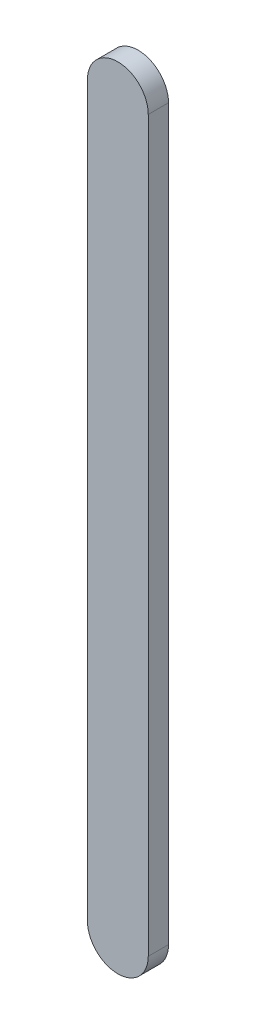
ISO-10303-21;
HEADER;
FILE_DESCRIPTION(('STEP AP214'),'2;1');
FILE_NAME('part.step','',(''),(''),'','','');
FILE_SCHEMA(('AUTOMOTIVE_DESIGN { 1 0 10303 214 1 1 1 1 }'));
ENDSEC;
DATA;
#1=APPLICATION_CONTEXT('core data for automotive mechanical design processes');
#2=APPLICATION_PROTOCOL_DEFINITION('international standard','automotive_design',2000,#1);
#3=PRODUCT_CONTEXT('',#1,'mechanical');
#4=PRODUCT('Part','Part','',(#3));
#5=PRODUCT_RELATED_PRODUCT_CATEGORY('part','',(#4));
#6=PRODUCT_DEFINITION_FORMATION('','',#4);
#7=PRODUCT_DEFINITION_CONTEXT('part definition',#1,'design');
#8=PRODUCT_DEFINITION('design','',#6,#7);
#9=PRODUCT_DEFINITION_SHAPE('','',#8);
#10=(LENGTH_UNIT() NAMED_UNIT(*) SI_UNIT(.MILLI.,.METRE.));
#11=(NAMED_UNIT(*) PLANE_ANGLE_UNIT() SI_UNIT($,.RADIAN.));
#12=(NAMED_UNIT(*) SI_UNIT($,.STERADIAN.) SOLID_ANGLE_UNIT());
#13=UNCERTAINTY_MEASURE_WITH_UNIT(LENGTH_MEASURE(1.E-05),#10,'distance_accuracy_value','');
#14=(GEOMETRIC_REPRESENTATION_CONTEXT(3) GLOBAL_UNCERTAINTY_ASSIGNED_CONTEXT((#13)) GLOBAL_UNIT_ASSIGNED_CONTEXT((#10,
#11,#12)) REPRESENTATION_CONTEXT('',''));
#15=CARTESIAN_POINT('',(0.,0.,0.));
#16=DIRECTION('',(0.,0.,1.));
#17=DIRECTION('',(1.,0.,0.));
#18=AXIS2_PLACEMENT_3D('',#15,#16,#17);
#19=CARTESIAN_POINT('',(0.,0.,3.175));
#20=DIRECTION('',(0.,0.,-1.));
#21=DIRECTION('',(-1.,0.,0.));
#22=AXIS2_PLACEMENT_3D('',#19,#20,#21);
#23=CYLINDRICAL_SURFACE('',#22,4.7625);
#24=CARTESIAN_POINT('',(0.,0.,0.));
#25=DIRECTION('',(0.,0.,1.));
#26=DIRECTION('',(1.,0.,0.));
#27=AXIS2_PLACEMENT_3D('',#24,#25,#26);
#28=CIRCLE('',#27,4.7625);
#29=CARTESIAN_POINT('',(4.7625,0.,0.));
#30=VERTEX_POINT('',#29);
#31=CARTESIAN_POINT('',(-4.7625,0.,0.));
#32=VERTEX_POINT('',#31);
#33=EDGE_CURVE('E100',#30,#32,#28,.T.);
#34=ORIENTED_EDGE('',*,*,#33,.T.);
#35=DIRECTION('',(0.,0.,-1.));
#36=VECTOR('',#35,1.);
#37=CARTESIAN_POINT('',(-4.7625,0.,3.175));
#38=LINE('',#37,#36);
#39=CARTESIAN_POINT('',(-4.7625,0.,3.175));
#40=VERTEX_POINT('',#39);
#41=EDGE_CURVE('E11',#40,#32,#38,.T.);
#42=ORIENTED_EDGE('',*,*,#41,.F.);
#43=CARTESIAN_POINT('',(0.,0.,3.175));
#44=DIRECTION('',(0.,0.,1.));
#45=DIRECTION('',(1.,0.,0.));
#46=AXIS2_PLACEMENT_3D('',#43,#44,#45);
#47=CIRCLE('',#46,4.7625);
#48=CARTESIAN_POINT('',(4.7625,0.,3.175));
#49=VERTEX_POINT('',#48);
#50=EDGE_CURVE('E88',#49,#40,#47,.T.);
#51=ORIENTED_EDGE('',*,*,#50,.F.);
#52=DIRECTION('',(0.,0.,-1.));
#53=VECTOR('',#52,1.);
#54=CARTESIAN_POINT('',(4.7625,0.,3.175));
#55=LINE('',#54,#53);
#56=EDGE_CURVE('E96',#49,#30,#55,.T.);
#57=ORIENTED_EDGE('',*,*,#56,.T.);
#58=EDGE_LOOP('',(#34,#42,#51,#57));
#59=FACE_BOUND('',#58,.T.);
#60=ADVANCED_FACE('F37',(#59),#23,.T.);
#61=CARTESIAN_POINT('',(-4.7625,0.,3.175));
#62=DIRECTION('',(1.,0.,0.));
#63=DIRECTION('',(0.,0.,-1.));
#64=AXIS2_PLACEMENT_3D('',#61,#62,#63);
#65=PLANE('',#64);
#66=DIRECTION('',(0.,-1.,0.));
#67=VECTOR('',#66,1.);
#68=CARTESIAN_POINT('',(-4.7625,0.,0.));
#69=LINE('',#68,#67);
#70=CARTESIAN_POINT('',(-4.76250000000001,-114.3,0.));
#71=VERTEX_POINT('',#70);
#72=EDGE_CURVE('E92',#32,#71,#69,.T.);
#73=ORIENTED_EDGE('',*,*,#72,.T.);
#74=DIRECTION('',(0.,0.,-1.));
#75=VECTOR('',#74,1.);
#76=CARTESIAN_POINT('',(-4.76250000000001,-114.3,3.175));
#77=LINE('',#76,#75);
#78=CARTESIAN_POINT('',(-4.76250000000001,-114.3,3.175));
#79=VERTEX_POINT('',#78);
#80=EDGE_CURVE('E45',#79,#71,#77,.T.);
#81=ORIENTED_EDGE('',*,*,#80,.F.);
#82=DIRECTION('',(0.,-1.,0.));
#83=VECTOR('',#82,1.);
#84=CARTESIAN_POINT('',(-4.7625,0.,3.175));
#85=LINE('',#84,#83);
#86=EDGE_CURVE('E83',#40,#79,#85,.T.);
#87=ORIENTED_EDGE('',*,*,#86,.F.);
#88=ORIENTED_EDGE('',*,*,#41,.T.);
#89=EDGE_LOOP('',(#73,#81,#87,#88));
#90=FACE_BOUND('',#89,.T.);
#91=ADVANCED_FACE('F91',(#90),#65,.F.);
#92=CARTESIAN_POINT('',(0.,-114.3,3.175));
#93=DIRECTION('',(0.,0.,-1.));
#94=DIRECTION('',(-1.,0.,0.));
#95=AXIS2_PLACEMENT_3D('',#92,#93,#94);
#96=CYLINDRICAL_SURFACE('',#95,4.76250000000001);
#97=CARTESIAN_POINT('',(0.,-114.3,0.));
#98=DIRECTION('',(0.,0.,1.));
#99=DIRECTION('',(1.,0.,0.));
#100=AXIS2_PLACEMENT_3D('',#97,#98,#99);
#101=CIRCLE('',#100,4.76250000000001);
#102=CARTESIAN_POINT('',(4.76250000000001,-114.3,0.));
#103=VERTEX_POINT('',#102);
#104=EDGE_CURVE('E70',#71,#103,#101,.T.);
#105=ORIENTED_EDGE('',*,*,#104,.T.);
#106=DIRECTION('',(0.,0.,-1.));
#107=VECTOR('',#106,1.);
#108=CARTESIAN_POINT('',(4.76250000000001,-114.3,3.175));
#109=LINE('',#108,#107);
#110=CARTESIAN_POINT('',(4.76250000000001,-114.3,3.175));
#111=VERTEX_POINT('',#110);
#112=EDGE_CURVE('E93',#111,#103,#109,.T.);
#113=ORIENTED_EDGE('',*,*,#112,.F.);
#114=CARTESIAN_POINT('',(0.,-114.3,3.175));
#115=DIRECTION('',(0.,0.,1.));
#116=DIRECTION('',(1.,0.,0.));
#117=AXIS2_PLACEMENT_3D('',#114,#115,#116);
#118=CIRCLE('',#117,4.76250000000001);
#119=EDGE_CURVE('E86',#79,#111,#118,.T.);
#120=ORIENTED_EDGE('',*,*,#119,.F.);
#121=ORIENTED_EDGE('',*,*,#80,.T.);
#122=EDGE_LOOP('',(#105,#113,#120,#121));
#123=FACE_BOUND('',#122,.T.);
#124=ADVANCED_FACE('F94',(#123),#96,.T.);
#125=CARTESIAN_POINT('',(4.7625,0.,3.175));
#126=DIRECTION('',(-1.,0.,0.));
#127=DIRECTION('',(0.,-1.,0.));
#128=AXIS2_PLACEMENT_3D('',#125,#126,#127);
#129=PLANE('',#128);
#130=DIRECTION('',(0.,1.,0.));
#131=VECTOR('',#130,1.);
#132=CARTESIAN_POINT('',(4.7625,0.,0.));
#133=LINE('',#132,#131);
#134=EDGE_CURVE('E76',#103,#30,#133,.T.);
#135=ORIENTED_EDGE('',*,*,#134,.T.);
#136=ORIENTED_EDGE('',*,*,#56,.F.);
#137=DIRECTION('',(0.,1.,0.));
#138=VECTOR('',#137,1.);
#139=CARTESIAN_POINT('',(4.7625,0.,3.175));
#140=LINE('',#139,#138);
#141=EDGE_CURVE('E53',#111,#49,#140,.T.);
#142=ORIENTED_EDGE('',*,*,#141,.F.);
#143=ORIENTED_EDGE('',*,*,#112,.T.);
#144=EDGE_LOOP('',(#135,#136,#142,#143));
#145=FACE_BOUND('',#144,.T.);
#146=ADVANCED_FACE('F107',(#145),#129,.F.);
#147=CARTESIAN_POINT('',(0.,0.,3.175));
#148=DIRECTION('',(0.,0.,1.));
#149=DIRECTION('',(1.,0.,0.));
#150=AXIS2_PLACEMENT_3D('',#147,#148,#149);
#151=PLANE('',#150);
#152=ORIENTED_EDGE('',*,*,#50,.T.);
#153=ORIENTED_EDGE('',*,*,#86,.T.);
#154=ORIENTED_EDGE('',*,*,#119,.T.);
#155=ORIENTED_EDGE('',*,*,#141,.T.);
#156=EDGE_LOOP('',(#152,#153,#154,#155));
#157=FACE_BOUND('',#156,.T.);
#158=ADVANCED_FACE('F84',(#157),#151,.T.);
#159=CARTESIAN_POINT('',(0.,0.,0.));
#160=DIRECTION('',(0.,0.,1.));
#161=DIRECTION('',(1.,0.,0.));
#162=AXIS2_PLACEMENT_3D('',#159,#160,#161);
#163=PLANE('',#162);
#164=ORIENTED_EDGE('',*,*,#33,.F.);
#165=ORIENTED_EDGE('',*,*,#134,.F.);
#166=ORIENTED_EDGE('',*,*,#104,.F.);
#167=ORIENTED_EDGE('',*,*,#72,.F.);
#168=EDGE_LOOP('',(#164,#165,#166,#167));
#169=FACE_BOUND('',#168,.T.);
#170=ADVANCED_FACE('F110',(#169),#163,.F.);
#171=CLOSED_SHELL('',(#60,#91,#124,#146,#158,#170));
#172=MANIFOLD_SOLID_BREP('B2',#171);
#173=ADVANCED_BREP_SHAPE_REPRESENTATION('',(#18,#172),#14);
#174=SHAPE_DEFINITION_REPRESENTATION(#9,#173);
ENDSEC;
END-ISO-10303-21;
